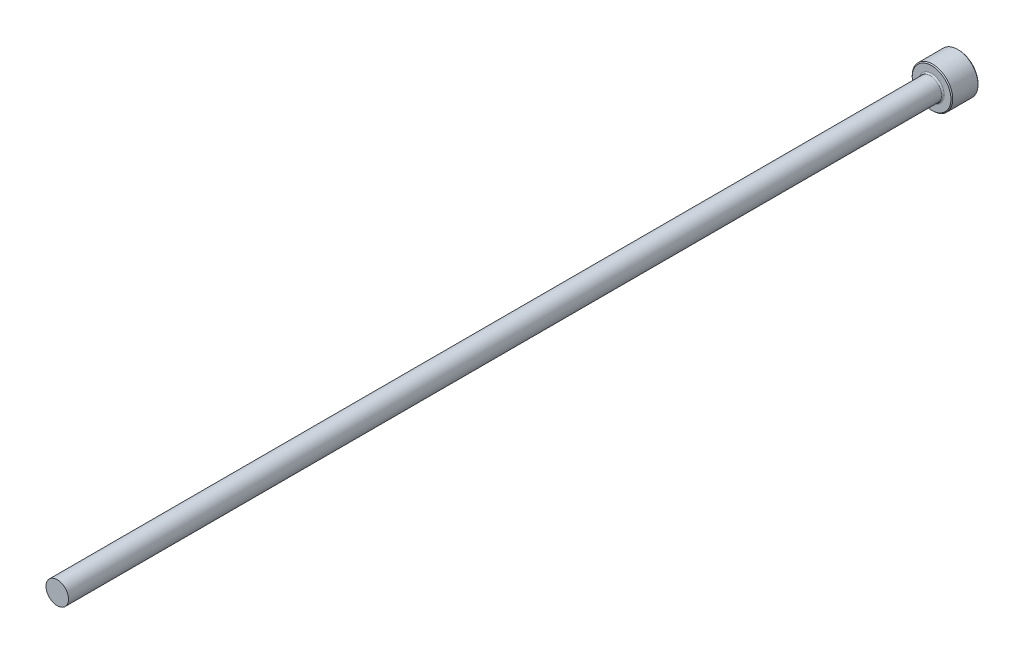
from build123d import *

# Parameters (mm, degrees)
CHAMFER1_SIZE = 0.2


with BuildPart() as part:
    # Sketch1 → Revolve1 (revolve)
    with BuildSketch(Plane(origin=(0, 0, 0), x_dir=(0, 0, -1), z_dir=(1, 0, 0)), mode=Mode.PRIVATE) as revolve1_sk:
        with BuildLine():
            Line((0, 0), (0, 4.5))
            Line((0, 4.5), (-6, 4.5))
            Line((-6, 4.5), (-6, 2.8))
            ThreePointArc((-6, 2.8), (-6.087867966, 2.587867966), (-6.3, 2.5))
            Line((-6.3, 2.5), (-200, 2.5))
            Line((-200, 2.5), (-200, 0))
            Line((-200, 0), (0, 0))
        make_face()
    revolve(revolve1_sk.sketch.rotate(Axis((0, 0, 109.05062828), (0, 0, -1)), 90), axis=Axis((0, 0, 109.05062828), (0, 0, -1)))

    # Chamfer1
    chamfer1_edges = [part.edges().sort_by_distance(p)[0] for p in [
        (-4.5, 0, 0),
        (-4.5, 0, 6),
    ]]
    chamfer(chamfer1_edges, length=CHAMFER1_SIZE)


solid = part.part
